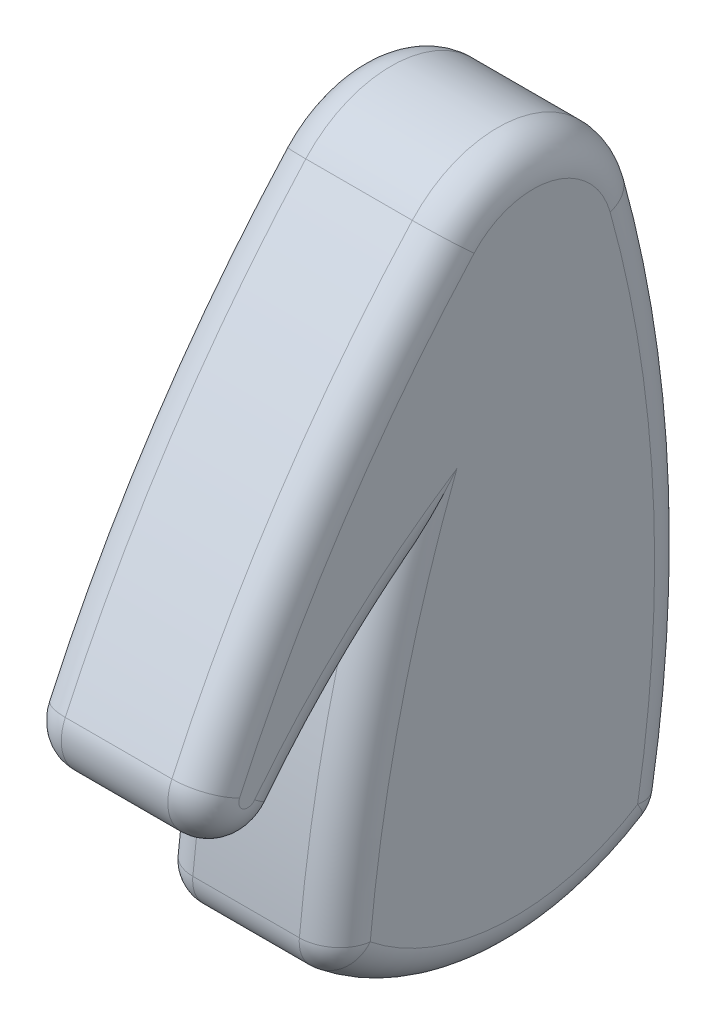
ISO-10303-21;
HEADER;
FILE_DESCRIPTION(('STEP AP214'),'2;1');
FILE_NAME('part.step','',(''),(''),'','','');
FILE_SCHEMA(('AUTOMOTIVE_DESIGN { 1 0 10303 214 1 1 1 1 }'));
ENDSEC;
DATA;
#1=APPLICATION_CONTEXT('core data for automotive mechanical design processes');
#2=APPLICATION_PROTOCOL_DEFINITION('international standard','automotive_design',2000,#1);
#3=PRODUCT_CONTEXT('',#1,'mechanical');
#4=PRODUCT('Part','Part','',(#3));
#5=PRODUCT_RELATED_PRODUCT_CATEGORY('part','',(#4));
#6=PRODUCT_DEFINITION_FORMATION('','',#4);
#7=PRODUCT_DEFINITION_CONTEXT('part definition',#1,'design');
#8=PRODUCT_DEFINITION('design','',#6,#7);
#9=PRODUCT_DEFINITION_SHAPE('','',#8);
#10=(LENGTH_UNIT() NAMED_UNIT(*) SI_UNIT(.MILLI.,.METRE.));
#11=(NAMED_UNIT(*) PLANE_ANGLE_UNIT() SI_UNIT($,.RADIAN.));
#12=(NAMED_UNIT(*) SI_UNIT($,.STERADIAN.) SOLID_ANGLE_UNIT());
#13=UNCERTAINTY_MEASURE_WITH_UNIT(LENGTH_MEASURE(1.E-05),#10,'distance_accuracy_value','');
#14=(GEOMETRIC_REPRESENTATION_CONTEXT(3) GLOBAL_UNCERTAINTY_ASSIGNED_CONTEXT((#13)) GLOBAL_UNIT_ASSIGNED_CONTEXT((#10,
#11,#12)) REPRESENTATION_CONTEXT('',''));
#15=CARTESIAN_POINT('',(0.,0.,0.));
#16=DIRECTION('',(0.,0.,1.));
#17=DIRECTION('',(1.,0.,0.));
#18=AXIS2_PLACEMENT_3D('',#15,#16,#17);
#19=CARTESIAN_POINT('',(279.4,-614.470114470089,-296.214944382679));
#20=DIRECTION('',(-1.,0.,0.));
#21=DIRECTION('',(0.,0.,1.));
#22=AXIS2_PLACEMENT_3D('',#19,#20,#21);
#23=CYLINDRICAL_SURFACE('',#22,406.4);
#24=DIRECTION('',(-1.,0.,0.));
#25=VECTOR('',#24,1.);
#26=CARTESIAN_POINT('',(279.4,-340.922578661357,4.33905351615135));
#27=LINE('',#26,#25);
#28=CARTESIAN_POINT('',(269.24,-340.922578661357,4.33905351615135));
#29=VERTEX_POINT('',#28);
#30=CARTESIAN_POINT('',(238.76,-340.922578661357,4.33905351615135));
#31=VERTEX_POINT('',#30);
#32=EDGE_CURVE('E150',#29,#31,#27,.T.);
#33=ORIENTED_EDGE('',*,*,#32,.T.);
#34=CARTESIAN_POINT('',(238.76,-614.470114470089,-296.214944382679));
#35=DIRECTION('',(1.,0.,0.));
#36=DIRECTION('',(0.,0.,-1.));
#37=AXIS2_PLACEMENT_3D('',#34,#35,#36);
#38=CIRCLE('',#37,406.4);
#39=CARTESIAN_POINT('',(238.76,-444.924083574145,73.129208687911));
#40=VERTEX_POINT('',#39);
#41=EDGE_CURVE('E157',#31,#40,#38,.T.);
#42=ORIENTED_EDGE('',*,*,#41,.T.);
#43=DIRECTION('',(-1.,0.,0.));
#44=VECTOR('',#43,1.);
#45=CARTESIAN_POINT('',(279.4,-444.924083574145,73.129208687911));
#46=LINE('',#45,#44);
#47=CARTESIAN_POINT('',(269.24,-444.924083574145,73.129208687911));
#48=VERTEX_POINT('',#47);
#49=EDGE_CURVE('E152',#48,#40,#46,.T.);
#50=ORIENTED_EDGE('',*,*,#49,.F.);
#51=CARTESIAN_POINT('',(269.24,-614.470114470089,-296.214944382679));
#52=DIRECTION('',(1.,0.,0.));
#53=DIRECTION('',(0.,0.,-1.));
#54=AXIS2_PLACEMENT_3D('',#51,#52,#53);
#55=CIRCLE('',#54,406.4);
#56=EDGE_CURVE('E148',#48,#29,#55,.F.);
#57=ORIENTED_EDGE('',*,*,#56,.T.);
#58=EDGE_LOOP('',(#33,#42,#50,#57));
#59=FACE_BOUND('',#58,.T.);
#60=ADVANCED_FACE('F34',(#59),#23,.T.);
#61=CARTESIAN_POINT('',(279.4,-450.222397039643,61.587203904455));
#62=DIRECTION('',(-1.,0.,0.));
#63=DIRECTION('',(0.,0.,1.));
#64=AXIS2_PLACEMENT_3D('',#61,#62,#63);
#65=CYLINDRICAL_SURFACE('',#64,12.7000000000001);
#66=ORIENTED_EDGE('',*,*,#49,.T.);
#67=CARTESIAN_POINT('',(238.76,-450.222397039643,61.587203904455));
#68=DIRECTION('',(1.,0.,0.));
#69=DIRECTION('',(0.,0.,-1.));
#70=AXIS2_PLACEMENT_3D('',#67,#68,#69);
#71=CIRCLE('',#70,12.7000000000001);
#72=CARTESIAN_POINT('',(238.76,-458.032291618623,51.572437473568));
#73=VERTEX_POINT('',#72);
#74=EDGE_CURVE('E209',#40,#73,#71,.T.);
#75=ORIENTED_EDGE('',*,*,#74,.T.);
#76=DIRECTION('',(-1.,0.,0.));
#77=VECTOR('',#76,1.);
#78=CARTESIAN_POINT('',(279.4,-458.032291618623,51.572437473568));
#79=LINE('',#78,#77);
#80=CARTESIAN_POINT('',(269.24,-458.032291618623,51.572437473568));
#81=VERTEX_POINT('',#80);
#82=EDGE_CURVE('E382',#81,#73,#79,.T.);
#83=ORIENTED_EDGE('',*,*,#82,.F.);
#84=CARTESIAN_POINT('',(269.24,-450.222397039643,61.587203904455));
#85=DIRECTION('',(1.,0.,0.));
#86=DIRECTION('',(0.,0.,-1.));
#87=AXIS2_PLACEMENT_3D('',#84,#85,#86);
#88=CIRCLE('',#87,12.7000000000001);
#89=EDGE_CURVE('E207',#81,#48,#88,.F.);
#90=ORIENTED_EDGE('',*,*,#89,.T.);
#91=EDGE_LOOP('',(#66,#75,#83,#90));
#92=FACE_BOUND('',#91,.T.);
#93=ADVANCED_FACE('F410',(#92),#65,.T.);
#94=CARTESIAN_POINT('',(279.4,-598.610394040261,-128.693358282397));
#95=DIRECTION('',(-1.,0.,0.));
#96=DIRECTION('',(0.,0.,1.));
#97=AXIS2_PLACEMENT_3D('',#94,#95,#96);
#98=CYLINDRICAL_SURFACE('',#97,228.6);
#99=ORIENTED_EDGE('',*,*,#82,.T.);
#100=CARTESIAN_POINT('',(238.76,-598.610394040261,-128.693358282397));
#101=DIRECTION('',(1.,0.,0.));
#102=DIRECTION('',(0.,0.,-1.));
#103=AXIS2_PLACEMENT_3D('',#100,#101,#102);
#104=CIRCLE('',#103,228.6);
#105=CARTESIAN_POINT('',(238.76,-426.690374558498,21.9767014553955));
#106=VERTEX_POINT('',#105);
#107=EDGE_CURVE('E213',#73,#106,#104,.F.);
#108=ORIENTED_EDGE('',*,*,#107,.T.);
#109=DIRECTION('',(-1.,0.,0.));
#110=VECTOR('',#109,1.);
#111=CARTESIAN_POINT('',(279.4,-426.690374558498,21.9767014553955));
#112=LINE('',#111,#110);
#113=CARTESIAN_POINT('',(269.24,-426.690374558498,21.9767014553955));
#114=VERTEX_POINT('',#113);
#115=EDGE_CURVE('E394',#114,#106,#112,.T.);
#116=ORIENTED_EDGE('',*,*,#115,.F.);
#117=CARTESIAN_POINT('',(269.24,-598.610394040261,-128.693358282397));
#118=DIRECTION('',(1.,0.,0.));
#119=DIRECTION('',(0.,0.,-1.));
#120=AXIS2_PLACEMENT_3D('',#117,#118,#119);
#121=CIRCLE('',#120,228.6);
#122=EDGE_CURVE('E211',#114,#81,#121,.T.);
#123=ORIENTED_EDGE('',*,*,#122,.T.);
#124=EDGE_LOOP('',(#99,#108,#116,#123));
#125=FACE_BOUND('',#124,.T.);
#126=ADVANCED_FACE('F416',(#125),#98,.F.);
#127=CARTESIAN_POINT('',(279.4,-541.431144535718,-367.889321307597));
#128=DIRECTION('',(-1.,0.,0.));
#129=DIRECTION('',(0.,0.,1.));
#130=AXIS2_PLACEMENT_3D('',#127,#128,#129);
#131=CYLINDRICAL_SURFACE('',#130,406.4);
#132=ORIENTED_EDGE('',*,*,#115,.T.);
#133=CARTESIAN_POINT('',(238.76,-541.431144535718,-367.889321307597));
#134=DIRECTION('',(1.,0.,0.));
#135=DIRECTION('',(0.,0.,-1.));
#136=AXIS2_PLACEMENT_3D('',#133,#134,#135);
#137=CIRCLE('',#136,406.4);
#138=CARTESIAN_POINT('',(238.76,-502.534245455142,36.6449680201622));
#139=VERTEX_POINT('',#138);
#140=EDGE_CURVE('E217',#106,#139,#137,.T.);
#141=ORIENTED_EDGE('',*,*,#140,.T.);
#142=DIRECTION('',(-1.,0.,0.));
#143=VECTOR('',#142,1.);
#144=CARTESIAN_POINT('',(279.4,-502.534245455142,36.6449680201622));
#145=LINE('',#144,#143);
#146=CARTESIAN_POINT('',(269.24,-502.534245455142,36.6449680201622));
#147=VERTEX_POINT('',#146);
#148=EDGE_CURVE('E184',#139,#147,#145,.F.);
#149=ORIENTED_EDGE('',*,*,#148,.T.);
#150=CARTESIAN_POINT('',(269.24,-541.431144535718,-367.889321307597));
#151=DIRECTION('',(1.,0.,0.));
#152=DIRECTION('',(0.,0.,-1.));
#153=AXIS2_PLACEMENT_3D('',#150,#151,#152);
#154=CIRCLE('',#153,406.4);
#155=EDGE_CURVE('E215',#147,#114,#154,.F.);
#156=ORIENTED_EDGE('',*,*,#155,.T.);
#157=EDGE_LOOP('',(#132,#141,#149,#156));
#158=FACE_BOUND('',#157,.T.);
#159=ADVANCED_FACE('F392',(#158),#131,.T.);
#160=CARTESIAN_POINT('',(279.4,-451.882494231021,-14.653657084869));
#161=DIRECTION('',(-1.,0.,0.));
#162=DIRECTION('',(0.,0.,1.));
#163=AXIS2_PLACEMENT_3D('',#160,#161,#162);
#164=CYLINDRICAL_SURFACE('',#163,76.2);
#165=DIRECTION('',(-1.,0.,0.));
#166=VECTOR('',#165,1.);
#167=CARTESIAN_POINT('',(279.4,-511.448848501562,32.8678058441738));
#168=LINE('',#167,#166);
#169=CARTESIAN_POINT('',(269.24,-511.448848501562,32.8678058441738));
#170=VERTEX_POINT('',#169);
#171=CARTESIAN_POINT('',(238.76,-511.448848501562,32.8678058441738));
#172=VERTEX_POINT('',#171);
#173=EDGE_CURVE('E378',#170,#172,#168,.T.);
#174=ORIENTED_EDGE('',*,*,#173,.T.);
#175=CARTESIAN_POINT('',(238.76,-451.882494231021,-14.653657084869));
#176=DIRECTION('',(1.,0.,0.));
#177=DIRECTION('',(0.,0.,-1.));
#178=AXIS2_PLACEMENT_3D('',#175,#176,#177);
#179=CIRCLE('',#178,76.2);
#180=CARTESIAN_POINT('',(238.76,-516.276266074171,-55.3953083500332));
#181=VERTEX_POINT('',#180);
#182=EDGE_CURVE('E226',#172,#181,#179,.T.);
#183=ORIENTED_EDGE('',*,*,#182,.T.);
#184=DIRECTION('',(-1.,0.,0.));
#185=VECTOR('',#184,1.);
#186=CARTESIAN_POINT('',(279.4,-516.276266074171,-55.3953083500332));
#187=LINE('',#186,#185);
#188=CARTESIAN_POINT('',(269.24,-516.276266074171,-55.3953083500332));
#189=VERTEX_POINT('',#188);
#190=EDGE_CURVE('E189',#181,#189,#187,.F.);
#191=ORIENTED_EDGE('',*,*,#190,.T.);
#192=CARTESIAN_POINT('',(269.24,-451.882494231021,-14.653657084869));
#193=DIRECTION('',(1.,0.,0.));
#194=DIRECTION('',(0.,0.,-1.));
#195=AXIS2_PLACEMENT_3D('',#192,#193,#194);
#196=CIRCLE('',#195,76.2);
#197=EDGE_CURVE('E224',#189,#170,#196,.F.);
#198=ORIENTED_EDGE('',*,*,#197,.T.);
#199=EDGE_LOOP('',(#174,#183,#191,#198));
#200=FACE_BOUND('',#199,.T.);
#201=ADVANCED_FACE('F386',(#200),#164,.T.);
#202=CARTESIAN_POINT('',(279.4,-449.914387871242,290.61101913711));
#203=DIRECTION('',(-1.,0.,0.));
#204=DIRECTION('',(0.,0.,1.));
#205=AXIS2_PLACEMENT_3D('',#202,#203,#204);
#206=CYLINDRICAL_SURFACE('',#205,355.6);
#207=DIRECTION('',(-1.,0.,0.));
#208=VECTOR('',#207,1.);
#209=CARTESIAN_POINT('',(279.4,-509.3897251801,-59.9799736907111));
#210=LINE('',#209,#208);
#211=CARTESIAN_POINT('',(269.24,-509.3897251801,-59.9799736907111));
#212=VERTEX_POINT('',#211);
#213=CARTESIAN_POINT('',(238.76,-509.3897251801,-59.9799736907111));
#214=VERTEX_POINT('',#213);
#215=EDGE_CURVE('E374',#212,#214,#210,.T.);
#216=ORIENTED_EDGE('',*,*,#215,.T.);
#217=CARTESIAN_POINT('',(238.76,-449.914387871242,290.61101913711));
#218=DIRECTION('',(1.,0.,0.));
#219=DIRECTION('',(0.,0.,-1.));
#220=AXIS2_PLACEMENT_3D('',#217,#218,#219);
#221=CIRCLE('',#220,355.6);
#222=CARTESIAN_POINT('',(238.76,-354.266749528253,-51.8840746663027));
#223=VERTEX_POINT('',#222);
#224=EDGE_CURVE('E234',#214,#223,#221,.T.);
#225=ORIENTED_EDGE('',*,*,#224,.T.);
#226=DIRECTION('',(-1.,0.,0.));
#227=VECTOR('',#226,1.);
#228=CARTESIAN_POINT('',(279.4,-354.266749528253,-51.8840746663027));
#229=LINE('',#228,#227);
#230=CARTESIAN_POINT('',(269.24,-354.266749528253,-51.8840746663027));
#231=VERTEX_POINT('',#230);
#232=EDGE_CURVE('E169',#231,#223,#229,.T.);
#233=ORIENTED_EDGE('',*,*,#232,.F.);
#234=CARTESIAN_POINT('',(269.24,-449.914387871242,290.61101913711));
#235=DIRECTION('',(1.,0.,0.));
#236=DIRECTION('',(0.,0.,-1.));
#237=AXIS2_PLACEMENT_3D('',#234,#235,#236);
#238=CIRCLE('',#237,355.6);
#239=EDGE_CURVE('E232',#231,#212,#238,.F.);
#240=ORIENTED_EDGE('',*,*,#239,.T.);
#241=EDGE_LOOP('',(#216,#225,#233,#240));
#242=FACE_BOUND('',#241,.T.);
#243=ADVANCED_FACE('F377',(#242),#206,.T.);
#244=CARTESIAN_POINT('',(279.4,-363.148315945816,-20.0809588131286));
#245=DIRECTION('',(-1.,0.,0.));
#246=DIRECTION('',(0.,0.,1.));
#247=AXIS2_PLACEMENT_3D('',#244,#245,#246);
#248=CYLINDRICAL_SURFACE('',#247,33.02);
#249=ORIENTED_EDGE('',*,*,#232,.T.);
#250=CARTESIAN_POINT('',(238.76,-363.148315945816,-20.0809588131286));
#251=DIRECTION('',(1.,0.,0.));
#252=DIRECTION('',(0.,0.,-1.));
#253=AXIS2_PLACEMENT_3D('',#250,#251,#252);
#254=CIRCLE('',#253,33.02);
#255=EDGE_CURVE('E168',#223,#31,#254,.T.);
#256=ORIENTED_EDGE('',*,*,#255,.T.);
#257=ORIENTED_EDGE('',*,*,#32,.F.);
#258=CARTESIAN_POINT('',(269.24,-363.148315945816,-20.0809588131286));
#259=DIRECTION('',(1.,0.,0.));
#260=DIRECTION('',(0.,0.,-1.));
#261=AXIS2_PLACEMENT_3D('',#258,#259,#260);
#262=CIRCLE('',#261,33.02);
#263=EDGE_CURVE('E165',#29,#231,#262,.F.);
#264=ORIENTED_EDGE('',*,*,#263,.T.);
#265=EDGE_LOOP('',(#249,#256,#257,#264));
#266=FACE_BOUND('',#265,.T.);
#267=ADVANCED_FACE('F163',(#266),#248,.T.);
#268=CARTESIAN_POINT('',(279.4,-532.346255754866,-117.313870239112));
#269=DIRECTION('',(1.,0.,0.));
#270=DIRECTION('',(0.,0.,-1.));
#271=AXIS2_PLACEMENT_3D('',#268,#269,#270);
#272=PLANE('',#271);
#273=CARTESIAN_POINT('',(279.4,-598.610394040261,-128.693358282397));
#274=DIRECTION('',(1.,0.,0.));
#275=DIRECTION('',(0.,0.,-1.));
#276=AXIS2_PLACEMENT_3D('',#273,#274,#275);
#277=CIRCLE('',#276,238.76);
#278=CARTESIAN_POINT('',(279.4,-451.784375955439,59.5842506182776));
#279=VERTEX_POINT('',#278);
#280=CARTESIAN_POINT('',(279.4,-398.611600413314,1.71684127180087));
#281=VERTEX_POINT('',#280);
#282=EDGE_CURVE('E43',#279,#281,#277,.F.);
#283=ORIENTED_EDGE('',*,*,#282,.T.);
#284=CARTESIAN_POINT('',(279.4,-541.431144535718,-367.889321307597));
#285=DIRECTION('',(1.,0.,0.));
#286=DIRECTION('',(0.,0.,-1.));
#287=AXIS2_PLACEMENT_3D('',#284,#285,#286);
#288=CIRCLE('',#287,396.24);
#289=CARTESIAN_POINT('',(279.4,-503.506667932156,26.5316107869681));
#290=VERTEX_POINT('',#289);
#291=EDGE_CURVE('E11',#281,#290,#288,.T.);
#292=ORIENTED_EDGE('',*,*,#291,.T.);
#293=CARTESIAN_POINT('',(279.4,-451.882494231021,-14.653657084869));
#294=DIRECTION('',(1.,0.,0.));
#295=DIRECTION('',(0.,0.,-1.));
#296=AXIS2_PLACEMENT_3D('',#293,#294,#295);
#297=CIRCLE('',#296,66.04);
#298=CARTESIAN_POINT('',(279.4,-507.690429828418,-49.9630881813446));
#299=VERTEX_POINT('',#298);
#300=EDGE_CURVE('E236',#290,#299,#297,.T.);
#301=ORIENTED_EDGE('',*,*,#300,.T.);
#302=CARTESIAN_POINT('',(279.4,-449.914387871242,290.61101913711));
#303=DIRECTION('',(1.,0.,0.));
#304=DIRECTION('',(0.,0.,-1.));
#305=AXIS2_PLACEMENT_3D('',#302,#303,#304);
#306=CIRCLE('',#305,345.44);
#307=CARTESIAN_POINT('',(279.4,-356.999539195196,-42.0985005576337));
#308=VERTEX_POINT('',#307);
#309=EDGE_CURVE('E238',#299,#308,#306,.T.);
#310=ORIENTED_EDGE('',*,*,#309,.T.);
#311=CARTESIAN_POINT('',(279.4,-363.148315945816,-20.0809588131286));
#312=DIRECTION('',(1.,0.,0.));
#313=DIRECTION('',(0.,0.,-1.));
#314=AXIS2_PLACEMENT_3D('',#311,#312,#313);
#315=CIRCLE('',#314,22.86);
#316=CARTESIAN_POINT('',(279.4,-347.761267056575,-3.17479643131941));
#317=VERTEX_POINT('',#316);
#318=EDGE_CURVE('E240',#308,#317,#315,.T.);
#319=ORIENTED_EDGE('',*,*,#318,.T.);
#320=CARTESIAN_POINT('',(279.4,-614.470114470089,-296.214944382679));
#321=DIRECTION('',(1.,0.,0.));
#322=DIRECTION('',(0.,0.,-1.));
#323=AXIS2_PLACEMENT_3D('',#320,#321,#322);
#324=CIRCLE('',#323,396.24);
#325=CARTESIAN_POINT('',(279.4,-449.162734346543,63.8956048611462));
#326=VERTEX_POINT('',#325);
#327=EDGE_CURVE('E174',#317,#326,#324,.T.);
#328=ORIENTED_EDGE('',*,*,#327,.T.);
#329=CARTESIAN_POINT('',(279.4,-450.222397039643,61.587203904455));
#330=DIRECTION('',(1.,0.,0.));
#331=DIRECTION('',(0.,0.,-1.));
#332=AXIS2_PLACEMENT_3D('',#329,#330,#331);
#333=CIRCLE('',#332,2.5400000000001);
#334=EDGE_CURVE('E54',#326,#279,#333,.T.);
#335=ORIENTED_EDGE('',*,*,#334,.T.);
#336=EDGE_LOOP('',(#283,#292,#301,#310,#319,#328,#335));
#337=FACE_BOUND('',#336,.T.);
#338=ADVANCED_FACE('F330',(#337),#272,.T.);
#339=CARTESIAN_POINT('',(228.6,-532.346255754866,-117.313870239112));
#340=DIRECTION('',(1.,0.,0.));
#341=DIRECTION('',(0.,0.,-1.));
#342=AXIS2_PLACEMENT_3D('',#339,#340,#341);
#343=PLANE('',#342);
#344=CARTESIAN_POINT('',(228.6,-614.470114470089,-296.214944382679));
#345=DIRECTION('',(1.,0.,0.));
#346=DIRECTION('',(0.,0.,-1.));
#347=AXIS2_PLACEMENT_3D('',#344,#345,#346);
#348=CIRCLE('',#347,396.24);
#349=CARTESIAN_POINT('',(228.6,-449.162734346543,63.8956048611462));
#350=VERTEX_POINT('',#349);
#351=CARTESIAN_POINT('',(228.6,-347.761267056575,-3.17479643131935));
#352=VERTEX_POINT('',#351);
#353=EDGE_CURVE('E202',#350,#352,#348,.F.);
#354=ORIENTED_EDGE('',*,*,#353,.T.);
#355=CARTESIAN_POINT('',(228.6,-363.148315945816,-20.0809588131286));
#356=DIRECTION('',(1.,0.,0.));
#357=DIRECTION('',(0.,0.,-1.));
#358=AXIS2_PLACEMENT_3D('',#355,#356,#357);
#359=CIRCLE('',#358,22.86);
#360=CARTESIAN_POINT('',(228.6,-356.999539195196,-42.0985005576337));
#361=VERTEX_POINT('',#360);
#362=EDGE_CURVE('E158',#352,#361,#359,.F.);
#363=ORIENTED_EDGE('',*,*,#362,.T.);
#364=CARTESIAN_POINT('',(228.6,-449.914387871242,290.61101913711));
#365=DIRECTION('',(1.,0.,0.));
#366=DIRECTION('',(0.,0.,-1.));
#367=AXIS2_PLACEMENT_3D('',#364,#365,#366);
#368=CIRCLE('',#367,345.44);
#369=CARTESIAN_POINT('',(228.6,-507.690429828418,-49.9630881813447));
#370=VERTEX_POINT('',#369);
#371=EDGE_CURVE('E186',#361,#370,#368,.F.);
#372=ORIENTED_EDGE('',*,*,#371,.T.);
#373=CARTESIAN_POINT('',(228.6,-451.882494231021,-14.653657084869));
#374=DIRECTION('',(1.,0.,0.));
#375=DIRECTION('',(0.,0.,-1.));
#376=AXIS2_PLACEMENT_3D('',#373,#374,#375);
#377=CIRCLE('',#376,66.04);
#378=CARTESIAN_POINT('',(228.6,-503.506667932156,26.5316107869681));
#379=VERTEX_POINT('',#378);
#380=EDGE_CURVE('E194',#370,#379,#377,.F.);
#381=ORIENTED_EDGE('',*,*,#380,.T.);
#382=CARTESIAN_POINT('',(228.6,-541.431144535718,-367.889321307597));
#383=DIRECTION('',(1.,0.,0.));
#384=DIRECTION('',(0.,0.,-1.));
#385=AXIS2_PLACEMENT_3D('',#382,#383,#384);
#386=CIRCLE('',#385,396.24);
#387=CARTESIAN_POINT('',(228.6,-398.611600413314,1.71684127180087));
#388=VERTEX_POINT('',#387);
#389=EDGE_CURVE('E196',#379,#388,#386,.F.);
#390=ORIENTED_EDGE('',*,*,#389,.T.);
#391=CARTESIAN_POINT('',(228.6,-598.610394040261,-128.693358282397));
#392=DIRECTION('',(1.,0.,0.));
#393=DIRECTION('',(0.,0.,-1.));
#394=AXIS2_PLACEMENT_3D('',#391,#392,#393);
#395=CIRCLE('',#394,238.76);
#396=CARTESIAN_POINT('',(228.6,-451.784375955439,59.5842506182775));
#397=VERTEX_POINT('',#396);
#398=EDGE_CURVE('E198',#388,#397,#395,.T.);
#399=ORIENTED_EDGE('',*,*,#398,.T.);
#400=CARTESIAN_POINT('',(228.6,-450.222397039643,61.587203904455));
#401=DIRECTION('',(1.,0.,0.));
#402=DIRECTION('',(0.,0.,-1.));
#403=AXIS2_PLACEMENT_3D('',#400,#401,#402);
#404=CIRCLE('',#403,2.5400000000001);
#405=EDGE_CURVE('E200',#397,#350,#404,.F.);
#406=ORIENTED_EDGE('',*,*,#405,.T.);
#407=EDGE_LOOP('',(#354,#363,#372,#381,#390,#399,#406));
#408=FACE_BOUND('',#407,.T.);
#409=ADVANCED_FACE('F357',(#408),#343,.F.);
#410=CARTESIAN_POINT('',(279.4,-507.690429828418,-49.9630881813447));
#411=DIRECTION('',(-1.,0.,0.));
#412=DIRECTION('',(0.,0.,1.));
#413=AXIS2_PLACEMENT_3D('',#410,#411,#412);
#414=CYLINDRICAL_SURFACE('',#413,10.16);
#415=ORIENTED_EDGE('',*,*,#190,.F.);
#416=CARTESIAN_POINT('',(238.76,-507.690429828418,-49.9630881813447));
#417=DIRECTION('',(-1.,0.,0.));
#418=DIRECTION('',(0.,0.,1.));
#419=AXIS2_PLACEMENT_3D('',#416,#417,#418);
#420=CIRCLE('',#419,10.16);
#421=EDGE_CURVE('E230',#181,#214,#420,.F.);
#422=ORIENTED_EDGE('',*,*,#421,.T.);
#423=ORIENTED_EDGE('',*,*,#215,.F.);
#424=CARTESIAN_POINT('',(269.24,-507.690429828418,-49.9630881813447));
#425=DIRECTION('',(-1.,0.,0.));
#426=DIRECTION('',(0.,0.,1.));
#427=AXIS2_PLACEMENT_3D('',#424,#425,#426);
#428=CIRCLE('',#427,10.16);
#429=EDGE_CURVE('E228',#212,#189,#428,.T.);
#430=ORIENTED_EDGE('',*,*,#429,.T.);
#431=EDGE_LOOP('',(#415,#422,#423,#430));
#432=FACE_BOUND('',#431,.T.);
#433=ADVANCED_FACE('F373',(#432),#414,.T.);
#434=CARTESIAN_POINT('',(279.4,-503.506667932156,26.5316107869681));
#435=DIRECTION('',(-1.,0.,0.));
#436=DIRECTION('',(0.,0.,1.));
#437=AXIS2_PLACEMENT_3D('',#434,#435,#436);
#438=CYLINDRICAL_SURFACE('',#437,10.16);
#439=ORIENTED_EDGE('',*,*,#148,.F.);
#440=CARTESIAN_POINT('',(238.76,-503.506667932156,26.5316107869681));
#441=DIRECTION('',(-1.,0.,0.));
#442=DIRECTION('',(0.,0.,1.));
#443=AXIS2_PLACEMENT_3D('',#440,#441,#442);
#444=CIRCLE('',#443,10.16);
#445=EDGE_CURVE('E222',#139,#172,#444,.F.);
#446=ORIENTED_EDGE('',*,*,#445,.T.);
#447=ORIENTED_EDGE('',*,*,#173,.F.);
#448=CARTESIAN_POINT('',(269.24,-503.506667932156,26.5316107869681));
#449=DIRECTION('',(-1.,0.,0.));
#450=DIRECTION('',(0.,0.,1.));
#451=AXIS2_PLACEMENT_3D('',#448,#449,#450);
#452=CIRCLE('',#451,10.16);
#453=EDGE_CURVE('E219',#170,#147,#452,.T.);
#454=ORIENTED_EDGE('',*,*,#453,.T.);
#455=EDGE_LOOP('',(#439,#446,#447,#454));
#456=FACE_BOUND('',#455,.T.);
#457=ADVANCED_FACE('F285',(#456),#438,.T.);
#458=CARTESIAN_POINT('',(238.76,-503.506667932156,26.5316107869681));
#459=DIRECTION('',(0.,0.,1.));
#460=DIRECTION('',(1.,0.,0.));
#461=AXIS2_PLACEMENT_3D('',#458,#459,#460);
#462=SPHERICAL_SURFACE('',#461,10.16);
#463=CARTESIAN_POINT('',(238.76,-503.506667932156,26.5316107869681));
#464=DIRECTION('',(0.,-0.623641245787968,-0.781710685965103));
#465=DIRECTION('',(0.,0.781710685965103,-0.623641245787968));
#466=AXIS2_PLACEMENT_3D('',#463,#464,#465);
#467=CIRCLE('',#466,10.16);
#468=EDGE_CURVE('E268',#172,#379,#467,.T.);
#469=ORIENTED_EDGE('',*,*,#468,.F.);
#470=ORIENTED_EDGE('',*,*,#445,.F.);
#471=CARTESIAN_POINT('',(238.76,-503.506667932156,26.5316107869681));
#472=DIRECTION('',(0.,0.995409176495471,-0.0957108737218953));
#473=DIRECTION('',(0.,0.0957108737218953,0.995409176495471));
#474=AXIS2_PLACEMENT_3D('',#471,#472,#473);
#475=CIRCLE('',#474,10.16);
#476=EDGE_CURVE('E170',#379,#139,#475,.T.);
#477=ORIENTED_EDGE('',*,*,#476,.F.);
#478=EDGE_LOOP('',(#469,#470,#477));
#479=FACE_BOUND('',#478,.T.);
#480=ADVANCED_FACE('F278',(#479),#462,.T.);
#481=CARTESIAN_POINT('',(238.76,-541.431144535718,-367.889321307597));
#482=DIRECTION('',(1.,0.,0.));
#483=DIRECTION('',(0.,0.,-1.));
#484=AXIS2_PLACEMENT_3D('',#481,#482,#483);
#485=TOROIDAL_SURFACE('',#484,396.24,10.16);
#486=ORIENTED_EDGE('',*,*,#476,.T.);
#487=ORIENTED_EDGE('',*,*,#140,.F.);
#488=CARTESIAN_POINT('',(238.76,-426.690374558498,21.9767014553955));
#489=CARTESIAN_POINT('',(238.664123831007,-426.690425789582,21.9767336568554));
#490=CARTESIAN_POINT('',(238.568285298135,-426.686273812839,21.9740805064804));
#491=CARTESIAN_POINT('',(238.377733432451,-426.669965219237,21.9636562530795));
#492=CARTESIAN_POINT('',(238.283018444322,-426.657822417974,21.9558939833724));
#493=CARTESIAN_POINT('',(238.096863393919,-426.62617565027,21.9356588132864));
#494=CARTESIAN_POINT('',(238.0053953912,-426.606787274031,21.9232598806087));
#495=CARTESIAN_POINT('',(237.824843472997,-426.561275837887,21.8941452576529));
#496=CARTESIAN_POINT('',(237.735760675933,-426.535149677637,21.877427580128));
#497=CARTESIAN_POINT('',(237.429480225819,-426.433308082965,21.8122335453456));
#498=CARTESIAN_POINT('',(237.219570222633,-426.341790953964,21.753605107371));
#499=CARTESIAN_POINT('',(236.818806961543,-426.13186754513,21.6189120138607));
#500=CARTESIAN_POINT('',(236.628088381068,-426.013288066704,21.5427350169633));
#501=CARTESIAN_POINT('',(236.284641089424,-425.771699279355,21.3872573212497));
#502=CARTESIAN_POINT('',(236.130031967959,-425.650531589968,21.3091695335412));
#503=CARTESIAN_POINT('',(235.833600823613,-425.397650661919,21.145919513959));
#504=CARTESIAN_POINT('',(235.691789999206,-425.265928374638,21.0607512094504));
#505=CARTESIAN_POINT('',(235.419140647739,-424.994644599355,20.8850297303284));
#506=CARTESIAN_POINT('',(235.288315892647,-424.855073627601,20.7944700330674));
#507=CARTESIAN_POINT('',(235.036343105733,-424.570199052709,20.6092847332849));
#508=CARTESIAN_POINT('',(234.915191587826,-424.424897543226,20.514660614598));
#509=CARTESIAN_POINT('',(234.617753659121,-424.049865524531,20.2699584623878));
#510=CARTESIAN_POINT('',(234.447188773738,-423.817072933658,20.117630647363));
#511=CARTESIAN_POINT('',(234.122100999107,-423.344156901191,19.8072207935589));
#512=CARTESIAN_POINT('',(233.967586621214,-423.104029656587,19.6491357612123));
#513=CARTESIAN_POINT('',(233.671738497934,-422.618140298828,19.3282476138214));
#514=CARTESIAN_POINT('',(233.530428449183,-422.372369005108,19.1654366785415));
#515=CARTESIAN_POINT('',(233.259252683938,-421.876955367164,18.8361995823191));
#516=CARTESIAN_POINT('',(233.129388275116,-421.627312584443,18.6697730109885));
#517=CARTESIAN_POINT('',(232.878886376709,-421.123764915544,18.3329928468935));
#518=CARTESIAN_POINT('',(232.758303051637,-420.869844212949,18.162622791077));
#519=CARTESIAN_POINT('',(232.52591896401,-420.35976770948,17.8192619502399));
#520=CARTESIAN_POINT('',(232.414118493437,-420.103611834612,17.6462710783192));
#521=CARTESIAN_POINT('',(232.198449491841,-419.589876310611,17.2981851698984));
#522=CARTESIAN_POINT('',(232.094572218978,-419.332298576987,17.1230927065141));
#523=CARTESIAN_POINT('',(231.893831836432,-418.815826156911,16.7708532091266));
#524=CARTESIAN_POINT('',(231.796968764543,-418.556931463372,16.5937061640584));
#525=CARTESIAN_POINT('',(231.555738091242,-417.888964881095,16.1351402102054));
#526=CARTESIAN_POINT('',(231.416081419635,-417.479139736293,15.8523352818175));
#527=CARTESIAN_POINT('',(231.150582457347,-416.65785003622,15.2826208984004));
#528=CARTESIAN_POINT('',(231.024741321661,-416.246385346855,14.9957111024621));
#529=CARTESIAN_POINT('',(230.785367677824,-415.422334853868,14.4180927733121));
#530=CARTESIAN_POINT('',(230.671839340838,-415.009748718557,14.1273829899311));
#531=CARTESIAN_POINT('',(230.455992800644,-414.184070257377,13.5425513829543));
#532=CARTESIAN_POINT('',(230.353674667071,-413.77097792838,13.248429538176));
#533=CARTESIAN_POINT('',(230.159188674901,-412.943976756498,12.6565145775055));
#534=CARTESIAN_POINT('',(230.06703772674,-412.530067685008,12.3587162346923));
#535=CARTESIAN_POINT('',(229.892367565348,-411.702395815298,11.7600995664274));
#536=CARTESIAN_POINT('',(229.809848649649,-411.288633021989,11.4592811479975));
#537=CARTESIAN_POINT('',(229.575845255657,-410.04789603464,10.5524986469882));
#538=CARTESIAN_POINT('',(229.43791546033,-409.221478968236,9.94221142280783));
#539=CARTESIAN_POINT('',(229.255853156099,-407.985236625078,9.0197112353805));
#540=CARTESIAN_POINT('',(229.199359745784,-407.57423247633,8.71142354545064));
#541=CARTESIAN_POINT('',(229.094300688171,-406.753141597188,8.09234078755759));
#542=CARTESIAN_POINT('',(229.045734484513,-406.343054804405,7.78154589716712));
#543=CARTESIAN_POINT('',(228.911564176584,-405.114252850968,6.84544614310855));
#544=CARTESIAN_POINT('',(228.837496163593,-404.297049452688,6.21646599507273));
#545=CARTESIAN_POINT('',(228.71910032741,-402.6684677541,4.95004102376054));
#546=CARTESIAN_POINT('',(228.674741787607,-401.85708429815,4.31260564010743));
#547=CARTESIAN_POINT('',(228.615321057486,-400.240076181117,3.02923594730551));
#548=CARTESIAN_POINT('',(228.600255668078,-399.434450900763,2.38330257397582));
#549=CARTESIAN_POINT('',(228.600001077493,-398.625260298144,1.72790639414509));
#550=CARTESIAN_POINT('',(228.600000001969,-398.618430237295,1.72237397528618));
#551=CARTESIAN_POINT('',(228.6,-398.611600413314,1.71684127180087));
#552=B_SPLINE_CURVE_WITH_KNOTS('',3,(#488,#489,#490,#491,#492,#493,#494,#495,#496,#497,#498,
#499,#500,#501,#502,#503,#504,#505,#506,#507,#508,#509,#510,#511,#512,#513,#514,#515,#516,#517,
#518,#519,#520,#521,#522,#523,#524,#525,#526,#527,#528,#529,#530,#531,#532,#533,#534,#535,#536,
#537,#538,#539,#540,#541,#542,#543,#544,#545,#546,#547,#548,#549,#550,#551),.UNSPECIFIED.,.F.,
.F.,(4,2,2,2,2,2,2,2,2,2,2,2,2,2,2,2,2,2,2,2,2,2,2,2,2,2,2,2,2,2,2,4),(0.,0.287441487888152,
0.574387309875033,0.856938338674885,1.1396196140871,1.8443301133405,2.55368392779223,
3.18689894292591,3.82066275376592,4.4552095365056,5.08952659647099,6.06776570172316,
7.04652093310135,8.02700020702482,9.00759135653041,9.99352861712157,10.9794986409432,
11.9643645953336,12.9492358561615,14.5004185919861,16.0517309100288,17.603567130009,
19.1554129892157,20.7098022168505,22.2642394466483,25.3731354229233,26.9237034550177,
28.4741626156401,31.5752818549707,34.6731898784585,37.7707595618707,37.7971284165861),.UNSPECIFIED.);
#553=EDGE_CURVE('E260',#388,#106,#552,.F.);
#554=ORIENTED_EDGE('',*,*,#553,.F.);
#555=ORIENTED_EDGE('',*,*,#389,.F.);
#556=EDGE_LOOP('',(#486,#487,#554,#555));
#557=FACE_BOUND('',#556,.T.);
#558=ADVANCED_FACE('F273',(#557),#485,.T.);
#559=CARTESIAN_POINT('',(238.76,-451.882494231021,-14.653657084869));
#560=DIRECTION('',(1.,0.,0.));
#561=DIRECTION('',(0.,0.,-1.));
#562=AXIS2_PLACEMENT_3D('',#559,#560,#561);
#563=TOROIDAL_SURFACE('',#562,66.04,10.16);
#564=ORIENTED_EDGE('',*,*,#468,.T.);
#565=ORIENTED_EDGE('',*,*,#380,.F.);
#566=CARTESIAN_POINT('',(238.76,-507.690429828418,-49.9630881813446));
#567=DIRECTION('',(0.,0.534667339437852,-0.845062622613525));
#568=DIRECTION('',(0.,0.845062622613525,0.534667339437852));
#569=AXIS2_PLACEMENT_3D('',#566,#567,#568);
#570=CIRCLE('',#569,10.16);
#571=EDGE_CURVE('E257',#181,#370,#570,.T.);
#572=ORIENTED_EDGE('',*,*,#571,.F.);
#573=ORIENTED_EDGE('',*,*,#182,.F.);
#574=EDGE_LOOP('',(#564,#565,#572,#573));
#575=FACE_BOUND('',#574,.T.);
#576=ADVANCED_FACE('F277',(#575),#563,.T.);
#577=CARTESIAN_POINT('',(238.76,-598.610394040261,-128.693358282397));
#578=DIRECTION('',(1.,0.,0.));
#579=DIRECTION('',(0.,0.,-1.));
#580=AXIS2_PLACEMENT_3D('',#577,#578,#579);
#581=TOROIDAL_SURFACE('',#580,238.76,10.16);
#582=ORIENTED_EDGE('',*,*,#553,.T.);
#583=ORIENTED_EDGE('',*,*,#107,.F.);
#584=CARTESIAN_POINT('',(238.76,-451.784375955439,59.5842506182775));
#585=DIRECTION('',(0.,-0.788564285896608,0.61495232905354));
#586=DIRECTION('',(0.,-0.61495232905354,-0.788564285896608));
#587=AXIS2_PLACEMENT_3D('',#584,#585,#586);
#588=CIRCLE('',#587,10.16);
#589=EDGE_CURVE('E254',#397,#73,#588,.T.);
#590=ORIENTED_EDGE('',*,*,#589,.F.);
#591=ORIENTED_EDGE('',*,*,#398,.F.);
#592=EDGE_LOOP('',(#582,#583,#590,#591));
#593=FACE_BOUND('',#592,.T.);
#594=ADVANCED_FACE('F270',(#593),#581,.T.);
#595=CARTESIAN_POINT('',(238.76,-507.690429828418,-49.9630881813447));
#596=DIRECTION('',(0.,0.,1.));
#597=DIRECTION('',(1.,0.,0.));
#598=AXIS2_PLACEMENT_3D('',#595,#596,#597);
#599=SPHERICAL_SURFACE('',#598,10.16);
#600=ORIENTED_EDGE('',*,*,#421,.F.);
#601=ORIENTED_EDGE('',*,*,#571,.T.);
#602=CARTESIAN_POINT('',(238.76,-507.690429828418,-49.9630881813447));
#603=DIRECTION('',(0.,0.985913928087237,-0.167253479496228));
#604=DIRECTION('',(0.,0.167253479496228,0.985913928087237));
#605=AXIS2_PLACEMENT_3D('',#602,#603,#604);
#606=CIRCLE('',#605,10.16);
#607=EDGE_CURVE('E251',#214,#370,#606,.T.);
#608=ORIENTED_EDGE('',*,*,#607,.F.);
#609=EDGE_LOOP('',(#600,#601,#608));
#610=FACE_BOUND('',#609,.T.);
#611=ADVANCED_FACE('F368',(#610),#599,.T.);
#612=CARTESIAN_POINT('',(238.76,-450.222397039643,61.587203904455));
#613=DIRECTION('',(1.,0.,0.));
#614=DIRECTION('',(0.,0.,-1.));
#615=AXIS2_PLACEMENT_3D('',#612,#613,#614);
#616=DEGENERATE_TOROIDAL_SURFACE('',#615,2.5400000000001,10.16,.T.);
#617=ORIENTED_EDGE('',*,*,#589,.T.);
#618=ORIENTED_EDGE('',*,*,#74,.F.);
#619=CARTESIAN_POINT('',(238.76,-449.162734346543,63.8956048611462));
#620=DIRECTION('',(0.,0.908819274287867,-0.41719003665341));
#621=DIRECTION('',(0.,0.41719003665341,0.908819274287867));
#622=AXIS2_PLACEMENT_3D('',#619,#620,#621);
#623=CIRCLE('',#622,10.16);
#624=EDGE_CURVE('E248',#350,#40,#623,.T.);
#625=ORIENTED_EDGE('',*,*,#624,.F.);
#626=ORIENTED_EDGE('',*,*,#405,.F.);
#627=EDGE_LOOP('',(#617,#618,#625,#626));
#628=FACE_BOUND('',#627,.T.);
#629=ADVANCED_FACE('F401',(#628),#616,.T.);
#630=CARTESIAN_POINT('',(238.76,-449.914387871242,290.61101913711));
#631=DIRECTION('',(1.,0.,0.));
#632=DIRECTION('',(0.,0.,-1.));
#633=AXIS2_PLACEMENT_3D('',#630,#631,#632);
#634=TOROIDAL_SURFACE('',#633,345.44,10.16);
#635=ORIENTED_EDGE('',*,*,#607,.T.);
#636=ORIENTED_EDGE('',*,*,#371,.F.);
#637=CARTESIAN_POINT('',(238.76,-356.999539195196,-42.0985005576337));
#638=DIRECTION('',(0.,0.963147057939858,0.268975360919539));
#639=DIRECTION('',(0.,-0.268975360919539,0.963147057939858));
#640=AXIS2_PLACEMENT_3D('',#637,#638,#639);
#641=CIRCLE('',#640,10.16);
#642=EDGE_CURVE('E246',#223,#361,#641,.T.);
#643=ORIENTED_EDGE('',*,*,#642,.F.);
#644=ORIENTED_EDGE('',*,*,#224,.F.);
#645=EDGE_LOOP('',(#635,#636,#643,#644));
#646=FACE_BOUND('',#645,.T.);
#647=ADVANCED_FACE('F363',(#646),#634,.T.);
#648=CARTESIAN_POINT('',(238.76,-614.470114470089,-296.214944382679));
#649=DIRECTION('',(1.,0.,0.));
#650=DIRECTION('',(0.,0.,-1.));
#651=AXIS2_PLACEMENT_3D('',#648,#649,#650);
#652=TOROIDAL_SURFACE('',#651,396.24,10.16);
#653=ORIENTED_EDGE('',*,*,#624,.T.);
#654=ORIENTED_EDGE('',*,*,#41,.F.);
#655=CARTESIAN_POINT('',(238.76,-347.761267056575,-3.17479643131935));
#656=DIRECTION('',(0.,0.739552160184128,-0.673099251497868));
#657=DIRECTION('',(0.,0.673099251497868,0.739552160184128));
#658=AXIS2_PLACEMENT_3D('',#655,#656,#657);
#659=CIRCLE('',#658,10.16);
#660=EDGE_CURVE('E177',#352,#31,#659,.T.);
#661=ORIENTED_EDGE('',*,*,#660,.F.);
#662=ORIENTED_EDGE('',*,*,#353,.F.);
#663=EDGE_LOOP('',(#653,#654,#661,#662));
#664=FACE_BOUND('',#663,.T.);
#665=ADVANCED_FACE('F408',(#664),#652,.T.);
#666=CARTESIAN_POINT('',(238.76,-363.148315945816,-20.0809588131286));
#667=DIRECTION('',(1.,0.,0.));
#668=DIRECTION('',(0.,0.,-1.));
#669=AXIS2_PLACEMENT_3D('',#666,#667,#668);
#670=TOROIDAL_SURFACE('',#669,22.86,10.16);
#671=ORIENTED_EDGE('',*,*,#642,.T.);
#672=ORIENTED_EDGE('',*,*,#362,.F.);
#673=ORIENTED_EDGE('',*,*,#660,.T.);
#674=ORIENTED_EDGE('',*,*,#255,.F.);
#675=EDGE_LOOP('',(#671,#672,#673,#674));
#676=FACE_BOUND('',#675,.T.);
#677=ADVANCED_FACE('F406',(#676),#670,.T.);
#678=CARTESIAN_POINT('',(269.24,-614.470114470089,-296.214944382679));
#679=DIRECTION('',(1.,0.,0.));
#680=DIRECTION('',(0.,0.,-1.));
#681=AXIS2_PLACEMENT_3D('',#678,#679,#680);
#682=TOROIDAL_SURFACE('',#681,396.24,10.16);
#683=CARTESIAN_POINT('',(269.24,-449.162734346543,63.8956048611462));
#684=DIRECTION('',(0.,-0.908819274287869,0.417190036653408));
#685=DIRECTION('',(0.,-0.417190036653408,-0.908819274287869));
#686=AXIS2_PLACEMENT_3D('',#683,#684,#685);
#687=CIRCLE('',#686,10.16);
#688=EDGE_CURVE('E178',#326,#48,#687,.T.);
#689=ORIENTED_EDGE('',*,*,#688,.F.);
#690=ORIENTED_EDGE('',*,*,#327,.F.);
#691=CARTESIAN_POINT('',(269.24,-347.761267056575,-3.17479643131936));
#692=DIRECTION('',(0.,0.739552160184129,-0.673099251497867));
#693=DIRECTION('',(0.,0.673099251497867,0.739552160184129));
#694=AXIS2_PLACEMENT_3D('',#691,#692,#693);
#695=CIRCLE('',#694,10.16);
#696=EDGE_CURVE('E38',#29,#317,#695,.T.);
#697=ORIENTED_EDGE('',*,*,#696,.F.);
#698=ORIENTED_EDGE('',*,*,#56,.F.);
#699=EDGE_LOOP('',(#689,#690,#697,#698));
#700=FACE_BOUND('',#699,.T.);
#701=ADVANCED_FACE('F36',(#700),#682,.T.);
#702=CARTESIAN_POINT('',(269.24,-363.148315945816,-20.0809588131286));
#703=DIRECTION('',(1.,0.,0.));
#704=DIRECTION('',(0.,0.,-1.));
#705=AXIS2_PLACEMENT_3D('',#702,#703,#704);
#706=TOROIDAL_SURFACE('',#705,22.86,10.16);
#707=ORIENTED_EDGE('',*,*,#696,.T.);
#708=ORIENTED_EDGE('',*,*,#318,.F.);
#709=CARTESIAN_POINT('',(269.24,-356.999539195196,-42.0985005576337));
#710=DIRECTION('',(0.,-0.963147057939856,-0.268975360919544));
#711=DIRECTION('',(0.,0.268975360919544,-0.963147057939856));
#712=AXIS2_PLACEMENT_3D('',#709,#710,#711);
#713=CIRCLE('',#712,10.16);
#714=EDGE_CURVE('E182',#231,#308,#713,.T.);
#715=ORIENTED_EDGE('',*,*,#714,.F.);
#716=ORIENTED_EDGE('',*,*,#263,.F.);
#717=EDGE_LOOP('',(#707,#708,#715,#716));
#718=FACE_BOUND('',#717,.T.);
#719=ADVANCED_FACE('F180',(#718),#706,.T.);
#720=CARTESIAN_POINT('',(269.24,-450.222397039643,61.587203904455));
#721=DIRECTION('',(1.,0.,0.));
#722=DIRECTION('',(0.,0.,-1.));
#723=AXIS2_PLACEMENT_3D('',#720,#721,#722);
#724=DEGENERATE_TOROIDAL_SURFACE('',#723,2.5400000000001,10.16,.T.);
#725=ORIENTED_EDGE('',*,*,#688,.T.);
#726=ORIENTED_EDGE('',*,*,#89,.F.);
#727=CARTESIAN_POINT('',(269.24,-451.784375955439,59.5842506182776));
#728=DIRECTION('',(0.,0.788564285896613,-0.614952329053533));
#729=DIRECTION('',(0.,0.614952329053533,0.788564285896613));
#730=AXIS2_PLACEMENT_3D('',#727,#728,#729);
#731=CIRCLE('',#730,10.16);
#732=EDGE_CURVE('E317',#279,#81,#731,.T.);
#733=ORIENTED_EDGE('',*,*,#732,.F.);
#734=ORIENTED_EDGE('',*,*,#334,.F.);
#735=EDGE_LOOP('',(#725,#726,#733,#734));
#736=FACE_BOUND('',#735,.T.);
#737=ADVANCED_FACE('F322',(#736),#724,.T.);
#738=CARTESIAN_POINT('',(269.24,-449.914387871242,290.61101913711));
#739=DIRECTION('',(1.,0.,0.));
#740=DIRECTION('',(0.,0.,-1.));
#741=AXIS2_PLACEMENT_3D('',#738,#739,#740);
#742=TOROIDAL_SURFACE('',#741,345.44,10.16);
#743=ORIENTED_EDGE('',*,*,#714,.T.);
#744=ORIENTED_EDGE('',*,*,#309,.F.);
#745=CARTESIAN_POINT('',(269.24,-507.690429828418,-49.9630881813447));
#746=DIRECTION('',(0.,-0.985913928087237,0.167253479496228));
#747=DIRECTION('',(0.,-0.167253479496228,-0.985913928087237));
#748=AXIS2_PLACEMENT_3D('',#745,#746,#747);
#749=CIRCLE('',#748,10.16);
#750=EDGE_CURVE('E312',#212,#299,#749,.T.);
#751=ORIENTED_EDGE('',*,*,#750,.F.);
#752=ORIENTED_EDGE('',*,*,#239,.F.);
#753=EDGE_LOOP('',(#743,#744,#751,#752));
#754=FACE_BOUND('',#753,.T.);
#755=ADVANCED_FACE('F336',(#754),#742,.T.);
#756=CARTESIAN_POINT('',(269.24,-598.610394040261,-128.693358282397));
#757=DIRECTION('',(1.,0.,0.));
#758=DIRECTION('',(0.,0.,-1.));
#759=AXIS2_PLACEMENT_3D('',#756,#757,#758);
#760=TOROIDAL_SURFACE('',#759,238.76,10.16);
#761=ORIENTED_EDGE('',*,*,#732,.T.);
#762=ORIENTED_EDGE('',*,*,#122,.F.);
#763=CARTESIAN_POINT('',(269.24,-426.690374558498,21.9767014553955));
#764=CARTESIAN_POINT('',(269.335876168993,-426.690425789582,21.9767336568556));
#765=CARTESIAN_POINT('',(269.431714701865,-426.686273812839,21.9740805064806));
#766=CARTESIAN_POINT('',(269.622266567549,-426.669965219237,21.9636562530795));
#767=CARTESIAN_POINT('',(269.716981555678,-426.657822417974,21.9558939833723));
#768=CARTESIAN_POINT('',(269.903136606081,-426.62617565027,21.9356588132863));
#769=CARTESIAN_POINT('',(269.9946046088,-426.606787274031,21.9232598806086));
#770=CARTESIAN_POINT('',(270.175156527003,-426.561275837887,21.8941452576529));
#771=CARTESIAN_POINT('',(270.264239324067,-426.535149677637,21.8774275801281));
#772=CARTESIAN_POINT('',(270.570519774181,-426.433308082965,21.8122335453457));
#773=CARTESIAN_POINT('',(270.780429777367,-426.341790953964,21.7536051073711));
#774=CARTESIAN_POINT('',(271.181193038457,-426.13186754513,21.6189120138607));
#775=CARTESIAN_POINT('',(271.371911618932,-426.013288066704,21.5427350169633));
#776=CARTESIAN_POINT('',(271.715358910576,-425.771699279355,21.3872573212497));
#777=CARTESIAN_POINT('',(271.869968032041,-425.650531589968,21.3091695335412));
#778=CARTESIAN_POINT('',(272.166399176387,-425.397650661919,21.145919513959));
#779=CARTESIAN_POINT('',(272.308210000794,-425.265928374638,21.0607512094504));
#780=CARTESIAN_POINT('',(272.580859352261,-424.994644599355,20.8850297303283));
#781=CARTESIAN_POINT('',(272.711684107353,-424.855073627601,20.7944700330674));
#782=CARTESIAN_POINT('',(272.963656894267,-424.570199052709,20.6092847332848));
#783=CARTESIAN_POINT('',(273.084808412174,-424.424897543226,20.514660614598));
#784=CARTESIAN_POINT('',(273.382246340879,-424.049865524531,20.2699584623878));
#785=CARTESIAN_POINT('',(273.552811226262,-423.817072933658,20.1176306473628));
#786=CARTESIAN_POINT('',(273.877899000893,-423.34415690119,19.8072207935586));
#787=CARTESIAN_POINT('',(274.032413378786,-423.104029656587,19.6491357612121));
#788=CARTESIAN_POINT('',(274.328261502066,-422.618140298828,19.3282476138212));
#789=CARTESIAN_POINT('',(274.469571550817,-422.372369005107,19.1654366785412));
#790=CARTESIAN_POINT('',(274.740747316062,-421.876955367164,18.8361995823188));
#791=CARTESIAN_POINT('',(274.870611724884,-421.627312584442,18.6697730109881));
#792=CARTESIAN_POINT('',(275.121113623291,-421.123764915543,18.332992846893));
#793=CARTESIAN_POINT('',(275.241696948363,-420.869844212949,18.1626227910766));
#794=CARTESIAN_POINT('',(275.474081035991,-420.359767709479,17.8192619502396));
#795=CARTESIAN_POINT('',(275.585881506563,-420.103611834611,17.6462710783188));
#796=CARTESIAN_POINT('',(275.80155050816,-419.58987631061,17.298185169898));
#797=CARTESIAN_POINT('',(275.905427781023,-419.332298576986,17.1230927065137));
#798=CARTESIAN_POINT('',(276.106168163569,-418.815826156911,16.7708532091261));
#799=CARTESIAN_POINT('',(276.203031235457,-418.556931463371,16.593706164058));
#800=CARTESIAN_POINT('',(276.444261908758,-417.888964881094,16.1351402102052));
#801=CARTESIAN_POINT('',(276.583918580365,-417.479139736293,15.8523352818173));
#802=CARTESIAN_POINT('',(276.849417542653,-416.65785003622,15.2826208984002));
#803=CARTESIAN_POINT('',(276.975258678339,-416.246385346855,14.9957111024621));
#804=CARTESIAN_POINT('',(277.214632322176,-415.422334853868,14.4180927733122));
#805=CARTESIAN_POINT('',(277.328160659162,-415.009748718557,14.1273829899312));
#806=CARTESIAN_POINT('',(277.544007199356,-414.184070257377,13.5425513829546));
#807=CARTESIAN_POINT('',(277.646325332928,-413.77097792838,13.2484295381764));
#808=CARTESIAN_POINT('',(277.840811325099,-412.943976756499,12.6565145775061));
#809=CARTESIAN_POINT('',(277.93296227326,-412.530067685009,12.358716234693));
#810=CARTESIAN_POINT('',(278.107632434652,-411.702395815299,11.7600995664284));
#811=CARTESIAN_POINT('',(278.190151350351,-411.288633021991,11.4592811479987));
#812=CARTESIAN_POINT('',(278.424154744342,-410.047896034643,10.5524986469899));
#813=CARTESIAN_POINT('',(278.56208453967,-409.221478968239,9.94221142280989));
#814=CARTESIAN_POINT('',(278.7441468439,-407.985236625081,9.01971123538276));
#815=CARTESIAN_POINT('',(278.800640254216,-407.574232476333,8.7114235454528));
#816=CARTESIAN_POINT('',(278.905699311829,-406.753141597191,8.09234078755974));
#817=CARTESIAN_POINT('',(278.954265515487,-406.343054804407,7.78154589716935));
#818=CARTESIAN_POINT('',(279.088435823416,-405.114252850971,6.84544614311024));
#819=CARTESIAN_POINT('',(279.162503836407,-404.297049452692,6.2164659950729));
#820=CARTESIAN_POINT('',(279.28089967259,-402.668467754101,4.950041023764));
#821=CARTESIAN_POINT('',(279.325258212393,-401.857084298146,4.31260564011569));
#822=CARTESIAN_POINT('',(279.384678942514,-400.240076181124,3.02923594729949));
#823=CARTESIAN_POINT('',(279.399744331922,-399.434450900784,2.38330257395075));
#824=CARTESIAN_POINT('',(279.399998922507,-398.625260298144,1.72790639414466));
#825=CARTESIAN_POINT('',(279.399999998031,-398.618430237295,1.72237397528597));
#826=CARTESIAN_POINT('',(279.4,-398.611600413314,1.71684127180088));
#827=B_SPLINE_CURVE_WITH_KNOTS('',3,(#763,#764,#765,#766,#767,#768,#769,#770,#771,#772,#773,
#774,#775,#776,#777,#778,#779,#780,#781,#782,#783,#784,#785,#786,#787,#788,#789,#790,#791,#792,
#793,#794,#795,#796,#797,#798,#799,#800,#801,#802,#803,#804,#805,#806,#807,#808,#809,#810,#811,
#812,#813,#814,#815,#816,#817,#818,#819,#820,#821,#822,#823,#824,#825,#826),.UNSPECIFIED.,.F.,
.F.,(4,2,2,2,2,2,2,2,2,2,2,2,2,2,2,2,2,2,2,2,2,2,2,2,2,2,2,2,2,2,2,4),(0.,0.287441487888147,
0.574387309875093,0.856938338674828,1.13961961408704,1.84433011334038,2.55368392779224,
3.18689894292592,3.82066275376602,4.45520953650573,5.0895265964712,6.06776570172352,
7.04652093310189,8.0270002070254,9.00759135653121,9.99352861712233,10.9794986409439,
11.9643645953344,12.9492358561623,14.5004185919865,16.0517309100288,17.6035671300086,
19.1554129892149,20.7098022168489,22.264239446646,25.3731354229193,26.9237034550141,
28.4741626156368,31.5752818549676,34.6731898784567,37.7707595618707,37.7971284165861),.UNSPECIFIED.);
#828=EDGE_CURVE('E305',#281,#114,#827,.F.);
#829=ORIENTED_EDGE('',*,*,#828,.F.);
#830=ORIENTED_EDGE('',*,*,#282,.F.);
#831=EDGE_LOOP('',(#761,#762,#829,#830));
#832=FACE_BOUND('',#831,.T.);
#833=ADVANCED_FACE('F301',(#832),#760,.T.);
#834=CARTESIAN_POINT('',(269.24,-507.690429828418,-49.9630881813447));
#835=DIRECTION('',(0.,0.,1.));
#836=DIRECTION('',(1.,0.,0.));
#837=AXIS2_PLACEMENT_3D('',#834,#835,#836);
#838=SPHERICAL_SURFACE('',#837,10.16);
#839=ORIENTED_EDGE('',*,*,#429,.F.);
#840=ORIENTED_EDGE('',*,*,#750,.T.);
#841=CARTESIAN_POINT('',(269.24,-507.690429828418,-49.9630881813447));
#842=DIRECTION('',(0.,-0.534667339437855,0.845062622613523));
#843=DIRECTION('',(0.,-0.845062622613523,-0.534667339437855));
#844=AXIS2_PLACEMENT_3D('',#841,#842,#843);
#845=CIRCLE('',#844,10.16);
#846=EDGE_CURVE('E313',#189,#299,#845,.T.);
#847=ORIENTED_EDGE('',*,*,#846,.F.);
#848=EDGE_LOOP('',(#839,#840,#847));
#849=FACE_BOUND('',#848,.T.);
#850=ADVANCED_FACE('F299',(#849),#838,.T.);
#851=CARTESIAN_POINT('',(269.24,-541.431144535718,-367.889321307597));
#852=DIRECTION('',(1.,0.,0.));
#853=DIRECTION('',(0.,0.,-1.));
#854=AXIS2_PLACEMENT_3D('',#851,#852,#853);
#855=TOROIDAL_SURFACE('',#854,396.24,10.16);
#856=ORIENTED_EDGE('',*,*,#828,.T.);
#857=ORIENTED_EDGE('',*,*,#155,.F.);
#858=CARTESIAN_POINT('',(269.24,-503.506667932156,26.5316107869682));
#859=DIRECTION('',(0.,-0.995409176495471,0.0957108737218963));
#860=DIRECTION('',(0.,-0.0957108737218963,-0.995409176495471));
#861=AXIS2_PLACEMENT_3D('',#858,#859,#860);
#862=CIRCLE('',#861,10.16);
#863=EDGE_CURVE('E328',#290,#147,#862,.T.);
#864=ORIENTED_EDGE('',*,*,#863,.F.);
#865=ORIENTED_EDGE('',*,*,#291,.F.);
#866=EDGE_LOOP('',(#856,#857,#864,#865));
#867=FACE_BOUND('',#866,.T.);
#868=ADVANCED_FACE('F294',(#867),#855,.T.);
#869=CARTESIAN_POINT('',(269.24,-451.882494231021,-14.653657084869));
#870=DIRECTION('',(1.,0.,0.));
#871=DIRECTION('',(0.,0.,-1.));
#872=AXIS2_PLACEMENT_3D('',#869,#870,#871);
#873=TOROIDAL_SURFACE('',#872,66.04,10.16);
#874=ORIENTED_EDGE('',*,*,#846,.T.);
#875=ORIENTED_EDGE('',*,*,#300,.F.);
#876=CARTESIAN_POINT('',(269.24,-503.506667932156,26.5316107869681));
#877=DIRECTION('',(0.,0.623641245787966,0.781710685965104));
#878=DIRECTION('',(0.,-0.781710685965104,0.623641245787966));
#879=AXIS2_PLACEMENT_3D('',#876,#877,#878);
#880=CIRCLE('',#879,10.16);
#881=EDGE_CURVE('E341',#170,#290,#880,.T.);
#882=ORIENTED_EDGE('',*,*,#881,.F.);
#883=ORIENTED_EDGE('',*,*,#197,.F.);
#884=EDGE_LOOP('',(#874,#875,#882,#883));
#885=FACE_BOUND('',#884,.T.);
#886=ADVANCED_FACE('F290',(#885),#873,.T.);
#887=CARTESIAN_POINT('',(269.24,-503.506667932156,26.5316107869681));
#888=DIRECTION('',(0.,0.,1.));
#889=DIRECTION('',(1.,0.,0.));
#890=AXIS2_PLACEMENT_3D('',#887,#888,#889);
#891=SPHERICAL_SURFACE('',#890,10.16);
#892=ORIENTED_EDGE('',*,*,#863,.T.);
#893=ORIENTED_EDGE('',*,*,#453,.F.);
#894=ORIENTED_EDGE('',*,*,#881,.T.);
#895=EDGE_LOOP('',(#892,#893,#894));
#896=FACE_BOUND('',#895,.T.);
#897=ADVANCED_FACE('F287',(#896),#891,.T.);
#898=CLOSED_SHELL('',(#60,#93,#126,#159,#201,#243,#267,#338,#409,#433,#457,#480,#558,#576,#594,
#611,#629,#647,#665,#677,#701,#719,#737,#755,#833,#850,#868,#886,#897));
#899=MANIFOLD_SOLID_BREP('B2',#898);
#900=ADVANCED_BREP_SHAPE_REPRESENTATION('',(#18,#899),#14);
#901=SHAPE_DEFINITION_REPRESENTATION(#9,#900);
ENDSEC;
END-ISO-10303-21;
